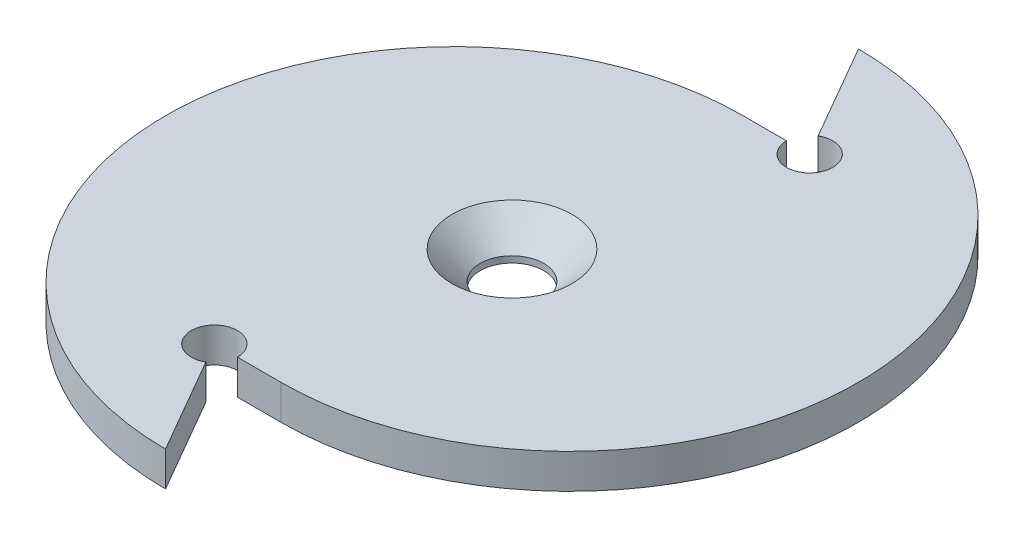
from build123d import *

# Parameters (mm, degrees)
EXTRUDE1_DEPTH = 3


with BuildPart() as part:
    # Sketch2 → Extrude1 (new body)
    with BuildSketch(Plane(origin=(0, 0, 0), x_dir=(1, 0, 0), z_dir=(0, 1, 0))):
        with BuildLine():
            Line((0, -20), (-3.773502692, -20))
            ThreePointArc((-3.773502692, -20), (-7.505553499, -19), (-4.773502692, -21.732050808))
            Line((-4.773502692, -21.732050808), (0, -30))
            ThreePointArc((0, -30), (-25, -5), (0, 20))
            Line((0, 20), (3.773502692, 20))
            ThreePointArc((3.773502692, 20), (7.505553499, 19), (4.773502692, 21.732050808))
            Line((4.773502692, 21.732050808), (0, 30))
            ThreePointArc((0, 30), (25, 5), (0, -20))
        make_face()
    extrude(amount=EXTRUDE1_DEPTH)

    # Sketch5 → CSK for M5 Countersunk Flat Head Screw1 (revolve, cut)
    with BuildSketch(Plane(origin=(0, 3, 0), x_dir=(0, 0, 1), z_dir=(1, 0, 0))):
        Polygon((0, 0), (0, 3), (2.75, 3), (2.75, 2.45), (5.2, 0), align=None)
    revolve(axis=Axis((0, 9.35, 0), (0, -1, 0)), mode=Mode.SUBTRACT)


solid = part.part
